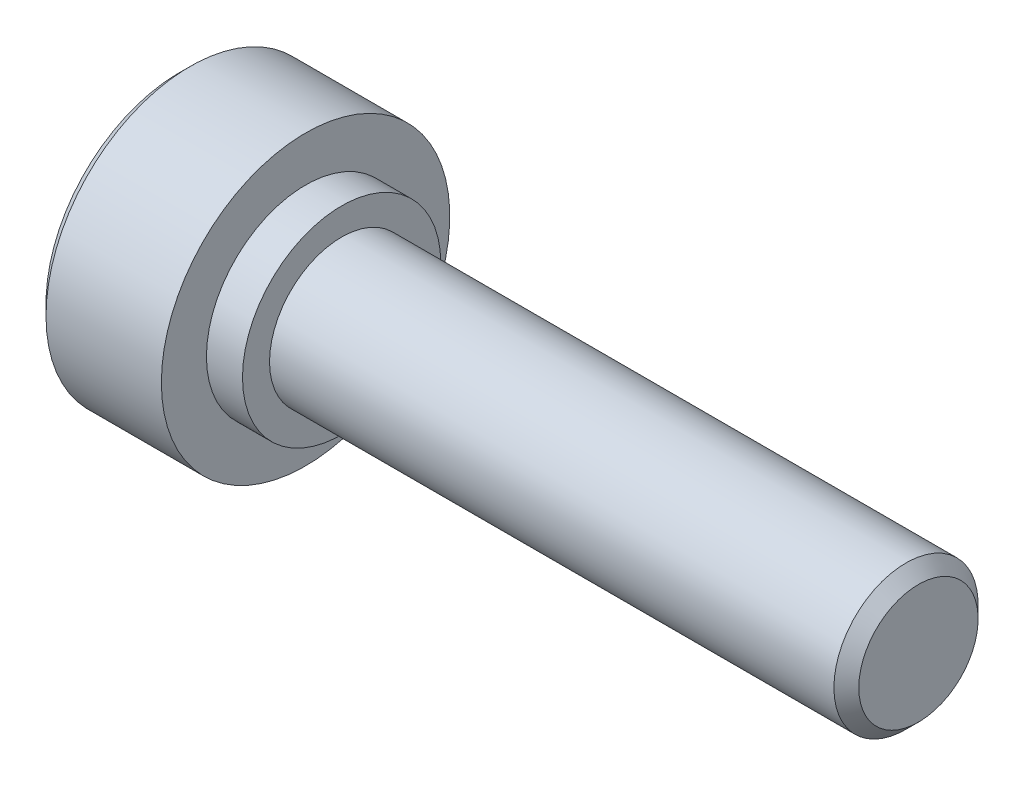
ISO-10303-21;
HEADER;
FILE_DESCRIPTION(('STEP AP214'),'2;1');
FILE_NAME('part.step','',(''),(''),'','','');
FILE_SCHEMA(('AUTOMOTIVE_DESIGN { 1 0 10303 214 1 1 1 1 }'));
ENDSEC;
DATA;
#1=APPLICATION_CONTEXT('core data for automotive mechanical design processes');
#2=APPLICATION_PROTOCOL_DEFINITION('international standard','automotive_design',2000,#1);
#3=PRODUCT_CONTEXT('',#1,'mechanical');
#4=PRODUCT('Part','Part','',(#3));
#5=PRODUCT_RELATED_PRODUCT_CATEGORY('part','',(#4));
#6=PRODUCT_DEFINITION_FORMATION('','',#4);
#7=PRODUCT_DEFINITION_CONTEXT('part definition',#1,'design');
#8=PRODUCT_DEFINITION('design','',#6,#7);
#9=PRODUCT_DEFINITION_SHAPE('','',#8);
#10=(LENGTH_UNIT() NAMED_UNIT(*) SI_UNIT(.MILLI.,.METRE.));
#11=(NAMED_UNIT(*) PLANE_ANGLE_UNIT() SI_UNIT($,.RADIAN.));
#12=(NAMED_UNIT(*) SI_UNIT($,.STERADIAN.) SOLID_ANGLE_UNIT());
#13=UNCERTAINTY_MEASURE_WITH_UNIT(LENGTH_MEASURE(1.E-05),#10,'distance_accuracy_value','');
#14=(GEOMETRIC_REPRESENTATION_CONTEXT(3) GLOBAL_UNCERTAINTY_ASSIGNED_CONTEXT((#13)) GLOBAL_UNIT_ASSIGNED_CONTEXT((#10,
#11,#12)) REPRESENTATION_CONTEXT('',''));
#15=CARTESIAN_POINT('',(0.,0.,0.));
#16=DIRECTION('',(0.,0.,1.));
#17=DIRECTION('',(1.,0.,0.));
#18=AXIS2_PLACEMENT_3D('',#15,#16,#17);
#19=CARTESIAN_POINT('',(0.,0.,0.));
#20=DIRECTION('',(-1.,0.,0.));
#21=DIRECTION('',(0.,0.,1.));
#22=AXIS2_PLACEMENT_3D('',#19,#20,#21);
#23=PLANE('',#22);
#24=CARTESIAN_POINT('',(0.,0.,0.));
#25=DIRECTION('',(-1.,0.,0.));
#26=DIRECTION('',(0.,0.,1.));
#27=AXIS2_PLACEMENT_3D('',#24,#25,#26);
#28=CIRCLE('',#27,7.4);
#29=CARTESIAN_POINT('',(0.,0.,-7.4));
#30=VERTEX_POINT('',#29);
#31=EDGE_CURVE('E45',#30,#30,#28,.T.);
#32=ORIENTED_EDGE('',*,*,#31,.T.);
#33=EDGE_LOOP('',(#32));
#34=FACE_BOUND('',#33,.T.);
#35=DIRECTION('',(0.,-0.5,-0.866025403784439));
#36=VECTOR('',#35,1.);
#37=CARTESIAN_POINT('',(0.,-1.73205080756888,3.));
#38=LINE('',#37,#36);
#39=CARTESIAN_POINT('',(0.,-1.73205080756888,3.));
#40=VERTEX_POINT('',#39);
#41=CARTESIAN_POINT('',(0.,-3.46410161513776,0.));
#42=VERTEX_POINT('',#41);
#43=EDGE_CURVE('E52',#40,#42,#38,.T.);
#44=ORIENTED_EDGE('',*,*,#43,.T.);
#45=DIRECTION('',(0.,0.5,-0.866025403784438));
#46=VECTOR('',#45,1.);
#47=CARTESIAN_POINT('',(0.,-3.46410161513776,0.));
#48=LINE('',#47,#46);
#49=CARTESIAN_POINT('',(0.,-1.73205080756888,-3.));
#50=VERTEX_POINT('',#49);
#51=EDGE_CURVE('E285',#42,#50,#48,.T.);
#52=ORIENTED_EDGE('',*,*,#51,.T.);
#53=DIRECTION('',(0.,1.,0.));
#54=VECTOR('',#53,1.);
#55=CARTESIAN_POINT('',(0.,-1.73205080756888,-3.));
#56=LINE('',#55,#54);
#57=CARTESIAN_POINT('',(0.,1.73205080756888,-3.));
#58=VERTEX_POINT('',#57);
#59=EDGE_CURVE('E132',#50,#58,#56,.T.);
#60=ORIENTED_EDGE('',*,*,#59,.T.);
#61=DIRECTION('',(0.,0.500000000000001,0.866025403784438));
#62=VECTOR('',#61,1.);
#63=CARTESIAN_POINT('',(0.,1.73205080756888,-3.));
#64=LINE('',#63,#62);
#65=CARTESIAN_POINT('',(0.,3.46410161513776,0.));
#66=VERTEX_POINT('',#65);
#67=EDGE_CURVE('E288',#58,#66,#64,.T.);
#68=ORIENTED_EDGE('',*,*,#67,.T.);
#69=DIRECTION('',(0.,-0.500000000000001,0.866025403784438));
#70=VECTOR('',#69,1.);
#71=CARTESIAN_POINT('',(0.,3.46410161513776,0.));
#72=LINE('',#71,#70);
#73=CARTESIAN_POINT('',(0.,1.73205080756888,3.));
#74=VERTEX_POINT('',#73);
#75=EDGE_CURVE('E290',#66,#74,#72,.T.);
#76=ORIENTED_EDGE('',*,*,#75,.T.);
#77=DIRECTION('',(0.,-1.,0.));
#78=VECTOR('',#77,1.);
#79=CARTESIAN_POINT('',(0.,1.73205080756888,3.));
#80=LINE('',#79,#78);
#81=EDGE_CURVE('E292',#74,#40,#80,.T.);
#82=ORIENTED_EDGE('',*,*,#81,.T.);
#83=EDGE_LOOP('',(#44,#52,#60,#68,#76,#82));
#84=FACE_BOUND('',#83,.T.);
#85=ADVANCED_FACE('F37',(#34,#84),#23,.T.);
#86=CARTESIAN_POINT('',(-6.34999999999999,0.,0.));
#87=DIRECTION('',(-1.,0.,0.));
#88=DIRECTION('',(0.,0.,1.));
#89=AXIS2_PLACEMENT_3D('',#86,#87,#88);
#90=CYLINDRICAL_SURFACE('',#89,8.);
#91=CARTESIAN_POINT('',(0.600000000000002,0.,0.));
#92=DIRECTION('',(-1.,0.,0.));
#93=DIRECTION('',(0.,0.,1.));
#94=AXIS2_PLACEMENT_3D('',#91,#92,#93);
#95=CIRCLE('',#94,8.);
#96=CARTESIAN_POINT('',(0.600000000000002,0.,-8.));
#97=VERTEX_POINT('',#96);
#98=EDGE_CURVE('E11',#97,#97,#95,.F.);
#99=ORIENTED_EDGE('',*,*,#98,.T.);
#100=EDGE_LOOP('',(#99));
#101=FACE_BOUND('',#100,.T.);
#102=CARTESIAN_POINT('',(7.,0.,0.));
#103=DIRECTION('',(-1.,0.,0.));
#104=DIRECTION('',(0.,0.,1.));
#105=AXIS2_PLACEMENT_3D('',#102,#103,#104);
#106=CIRCLE('',#105,8.);
#107=CARTESIAN_POINT('',(7.,0.,8.));
#108=VERTEX_POINT('',#107);
#109=EDGE_CURVE('E161',#108,#108,#106,.T.);
#110=ORIENTED_EDGE('',*,*,#109,.T.);
#111=EDGE_LOOP('',(#110));
#112=FACE_BOUND('',#111,.T.);
#113=ADVANCED_FACE('F180',(#101,#112),#90,.T.);
#114=CARTESIAN_POINT('',(7.,8.,0.));
#115=DIRECTION('',(1.,0.,0.));
#116=DIRECTION('',(0.,0.,-1.));
#117=AXIS2_PLACEMENT_3D('',#114,#115,#116);
#118=PLANE('',#117);
#119=CARTESIAN_POINT('',(7.,0.,0.));
#120=DIRECTION('',(-1.,0.,0.));
#121=DIRECTION('',(0.,0.,1.));
#122=AXIS2_PLACEMENT_3D('',#119,#120,#121);
#123=CIRCLE('',#122,5.5);
#124=CARTESIAN_POINT('',(7.,0.,5.5));
#125=VERTEX_POINT('',#124);
#126=EDGE_CURVE('E158',#125,#125,#123,.T.);
#127=ORIENTED_EDGE('',*,*,#126,.T.);
#128=EDGE_LOOP('',(#127));
#129=FACE_BOUND('',#128,.T.);
#130=ORIENTED_EDGE('',*,*,#109,.F.);
#131=EDGE_LOOP('',(#130));
#132=FACE_BOUND('',#131,.T.);
#133=ADVANCED_FACE('F184',(#129,#132),#118,.T.);
#134=CARTESIAN_POINT('',(-6.34999999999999,0.,0.));
#135=DIRECTION('',(-1.,0.,0.));
#136=DIRECTION('',(0.,0.,1.));
#137=AXIS2_PLACEMENT_3D('',#134,#135,#136);
#138=CYLINDRICAL_SURFACE('',#137,5.5);
#139=CARTESIAN_POINT('',(9.,0.,0.));
#140=DIRECTION('',(-1.,0.,0.));
#141=DIRECTION('',(0.,0.,1.));
#142=AXIS2_PLACEMENT_3D('',#139,#140,#141);
#143=CIRCLE('',#142,5.5);
#144=CARTESIAN_POINT('',(9.,0.,5.5));
#145=VERTEX_POINT('',#144);
#146=EDGE_CURVE('E155',#145,#145,#143,.T.);
#147=ORIENTED_EDGE('',*,*,#146,.T.);
#148=EDGE_LOOP('',(#147));
#149=FACE_BOUND('',#148,.T.);
#150=ORIENTED_EDGE('',*,*,#126,.F.);
#151=EDGE_LOOP('',(#150));
#152=FACE_BOUND('',#151,.T.);
#153=ADVANCED_FACE('F190',(#149,#152),#138,.T.);
#154=CARTESIAN_POINT('',(9.,5.5,0.));
#155=DIRECTION('',(1.,0.,0.));
#156=DIRECTION('',(0.,0.,-1.));
#157=AXIS2_PLACEMENT_3D('',#154,#155,#156);
#158=PLANE('',#157);
#159=CARTESIAN_POINT('',(9.,0.,0.));
#160=DIRECTION('',(-1.,0.,0.));
#161=DIRECTION('',(0.,0.,1.));
#162=AXIS2_PLACEMENT_3D('',#159,#160,#161);
#163=CIRCLE('',#162,4.00000000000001);
#164=CARTESIAN_POINT('',(9.,0.,4.00000000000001));
#165=VERTEX_POINT('',#164);
#166=EDGE_CURVE('E152',#165,#165,#163,.T.);
#167=ORIENTED_EDGE('',*,*,#166,.T.);
#168=EDGE_LOOP('',(#167));
#169=FACE_BOUND('',#168,.T.);
#170=ORIENTED_EDGE('',*,*,#146,.F.);
#171=EDGE_LOOP('',(#170));
#172=FACE_BOUND('',#171,.T.);
#173=ADVANCED_FACE('F194',(#169,#172),#158,.T.);
#174=CARTESIAN_POINT('',(-6.34999999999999,0.,0.));
#175=DIRECTION('',(-1.,0.,0.));
#176=DIRECTION('',(0.,0.,1.));
#177=AXIS2_PLACEMENT_3D('',#174,#175,#176);
#178=CYLINDRICAL_SURFACE('',#177,4.00000000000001);
#179=CARTESIAN_POINT('',(40.3095,0.,0.));
#180=DIRECTION('',(-1.,0.,0.));
#181=DIRECTION('',(0.,0.,1.));
#182=AXIS2_PLACEMENT_3D('',#179,#180,#181);
#183=CIRCLE('',#182,4.00000000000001);
#184=CARTESIAN_POINT('',(40.3095,0.,4.00000000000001));
#185=VERTEX_POINT('',#184);
#186=EDGE_CURVE('E149',#185,#185,#183,.T.);
#187=ORIENTED_EDGE('',*,*,#186,.T.);
#188=EDGE_LOOP('',(#187));
#189=FACE_BOUND('',#188,.T.);
#190=ORIENTED_EDGE('',*,*,#166,.F.);
#191=EDGE_LOOP('',(#190));
#192=FACE_BOUND('',#191,.T.);
#193=ADVANCED_FACE('F198',(#189,#192),#178,.T.);
#194=CARTESIAN_POINT('',(40.3095,0.,0.));
#195=DIRECTION('',(-1.,0.,0.));
#196=DIRECTION('',(0.,0.,1.));
#197=AXIS2_PLACEMENT_3D('',#194,#195,#196);
#198=CONICAL_SURFACE('',#197,4.00000000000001,0.785398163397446);
#199=CARTESIAN_POINT('',(41.,0.,0.));
#200=DIRECTION('',(-1.,0.,0.));
#201=DIRECTION('',(0.,0.,1.));
#202=AXIS2_PLACEMENT_3D('',#199,#200,#201);
#203=CIRCLE('',#202,3.3095);
#204=CARTESIAN_POINT('',(41.,0.,3.3095));
#205=VERTEX_POINT('',#204);
#206=EDGE_CURVE('E145',#205,#205,#203,.T.);
#207=ORIENTED_EDGE('',*,*,#206,.T.);
#208=EDGE_LOOP('',(#207));
#209=FACE_BOUND('',#208,.T.);
#210=ORIENTED_EDGE('',*,*,#186,.F.);
#211=EDGE_LOOP('',(#210));
#212=FACE_BOUND('',#211,.T.);
#213=ADVANCED_FACE('F175',(#209,#212),#198,.T.);
#214=CARTESIAN_POINT('',(41.,3.3095,0.));
#215=DIRECTION('',(1.,0.,0.));
#216=DIRECTION('',(0.,0.,-1.));
#217=AXIS2_PLACEMENT_3D('',#214,#215,#216);
#218=PLANE('',#217);
#219=ORIENTED_EDGE('',*,*,#206,.F.);
#220=EDGE_LOOP('',(#219));
#221=FACE_BOUND('',#220,.T.);
#222=ADVANCED_FACE('F168',(#221),#218,.T.);
#223=CARTESIAN_POINT('',(0.,0.,0.));
#224=DIRECTION('',(1.,0.,0.));
#225=DIRECTION('',(0.,0.,-1.));
#226=AXIS2_PLACEMENT_3D('',#223,#224,#225);
#227=CONICAL_SURFACE('',#226,7.4,0.785398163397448);
#228=CARTESIAN_POINT('',(0.600000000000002,0.,-8.));
#229=CARTESIAN_POINT('',(0.593750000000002,0.,-7.99375));
#230=CARTESIAN_POINT('',(0.587500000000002,0.,-7.9875));
#231=CARTESIAN_POINT('',(0.575000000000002,0.,-7.975));
#232=CARTESIAN_POINT('',(0.568750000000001,0.,-7.96875));
#233=CARTESIAN_POINT('',(0.556250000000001,0.,-7.95625));
#234=CARTESIAN_POINT('',(0.550000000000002,0.,-7.95));
#235=CARTESIAN_POINT('',(0.537500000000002,0.,-7.9375));
#236=CARTESIAN_POINT('',(0.531250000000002,0.,-7.93125));
#237=CARTESIAN_POINT('',(0.518750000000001,0.,-7.91875));
#238=CARTESIAN_POINT('',(0.512500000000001,0.,-7.9125));
#239=CARTESIAN_POINT('',(0.500000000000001,0.,-7.9));
#240=CARTESIAN_POINT('',(0.493750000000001,0.,-7.89375));
#241=CARTESIAN_POINT('',(0.481250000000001,0.,-7.88125));
#242=CARTESIAN_POINT('',(0.475000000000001,0.,-7.875));
#243=CARTESIAN_POINT('',(0.462500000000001,0.,-7.8625));
#244=CARTESIAN_POINT('',(0.456250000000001,0.,-7.85625));
#245=CARTESIAN_POINT('',(0.443750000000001,0.,-7.84375));
#246=CARTESIAN_POINT('',(0.437500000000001,0.,-7.8375));
#247=CARTESIAN_POINT('',(0.425000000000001,0.,-7.825));
#248=CARTESIAN_POINT('',(0.418750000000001,0.,-7.81875));
#249=CARTESIAN_POINT('',(0.406250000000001,0.,-7.80625));
#250=CARTESIAN_POINT('',(0.400000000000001,0.,-7.8));
#251=CARTESIAN_POINT('',(0.387500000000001,0.,-7.7875));
#252=CARTESIAN_POINT('',(0.381250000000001,0.,-7.78125));
#253=CARTESIAN_POINT('',(0.368750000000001,0.,-7.76875));
#254=CARTESIAN_POINT('',(0.362500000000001,0.,-7.7625));
#255=CARTESIAN_POINT('',(0.350000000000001,0.,-7.75));
#256=CARTESIAN_POINT('',(0.343750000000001,0.,-7.74375));
#257=CARTESIAN_POINT('',(0.331250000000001,0.,-7.73125));
#258=CARTESIAN_POINT('',(0.325000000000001,0.,-7.725));
#259=CARTESIAN_POINT('',(0.312500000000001,0.,-7.7125));
#260=CARTESIAN_POINT('',(0.306250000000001,0.,-7.70625));
#261=CARTESIAN_POINT('',(0.293750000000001,0.,-7.69375));
#262=CARTESIAN_POINT('',(0.287500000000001,0.,-7.6875));
#263=CARTESIAN_POINT('',(0.275000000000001,0.,-7.675));
#264=CARTESIAN_POINT('',(0.268750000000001,0.,-7.66875));
#265=CARTESIAN_POINT('',(0.256250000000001,0.,-7.65625));
#266=CARTESIAN_POINT('',(0.250000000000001,0.,-7.65));
#267=CARTESIAN_POINT('',(0.237500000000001,0.,-7.6375));
#268=CARTESIAN_POINT('',(0.231250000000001,0.,-7.63125));
#269=CARTESIAN_POINT('',(0.218750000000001,0.,-7.61875));
#270=CARTESIAN_POINT('',(0.2125,0.,-7.6125));
#271=CARTESIAN_POINT('',(0.200000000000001,0.,-7.6));
#272=CARTESIAN_POINT('',(0.193750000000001,0.,-7.59375));
#273=CARTESIAN_POINT('',(0.181250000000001,0.,-7.58125));
#274=CARTESIAN_POINT('',(0.175,0.,-7.575));
#275=CARTESIAN_POINT('',(0.1625,0.,-7.5625));
#276=CARTESIAN_POINT('',(0.15625,0.,-7.55625));
#277=CARTESIAN_POINT('',(0.143750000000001,0.,-7.54375));
#278=CARTESIAN_POINT('',(0.1375,0.,-7.5375));
#279=CARTESIAN_POINT('',(0.125,0.,-7.525));
#280=CARTESIAN_POINT('',(0.11875,0.,-7.51875));
#281=CARTESIAN_POINT('',(0.10625,0.,-7.50625));
#282=CARTESIAN_POINT('',(0.1,0.,-7.5));
#283=CARTESIAN_POINT('',(0.0875000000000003,0.,-7.4875));
#284=CARTESIAN_POINT('',(0.0812500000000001,0.,-7.48125));
#285=CARTESIAN_POINT('',(0.0687500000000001,0.,-7.46875));
#286=CARTESIAN_POINT('',(0.0625000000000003,0.,-7.4625));
#287=CARTESIAN_POINT('',(0.0500000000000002,0.,-7.45));
#288=CARTESIAN_POINT('',(0.0437500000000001,0.,-7.44375));
#289=CARTESIAN_POINT('',(0.03125,0.,-7.43125));
#290=CARTESIAN_POINT('',(0.0250000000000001,0.,-7.425));
#291=CARTESIAN_POINT('',(0.0125000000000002,0.,-7.4125));
#292=CARTESIAN_POINT('',(0.00625000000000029,0.,-7.40625));
#293=CARTESIAN_POINT('',(0.,0.,-7.4));
#294=B_SPLINE_CURVE_WITH_KNOTS('',3,(#228,#229,#230,#231,#232,#233,#234,#235,#236,#237,#238,
#239,#240,#241,#242,#243,#244,#245,#246,#247,#248,#249,#250,#251,#252,#253,#254,#255,#256,#257,
#258,#259,#260,#261,#262,#263,#264,#265,#266,#267,#268,#269,#270,#271,#272,#273,#274,#275,#276,
#277,#278,#279,#280,#281,#282,#283,#284,#285,#286,#287,#288,#289,#290,#291,#292,#293),
.UNSPECIFIED.,.F.,.F.,(4,2,2,2,2,2,2,2,2,2,2,2,2,2,2,2,2,2,2,2,2,2,2,2,2,2,2,2,2,2,2,2,4),(0.,
0.0265165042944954,0.0530330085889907,0.0795495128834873,0.106066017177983,0.132582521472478,
0.159099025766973,0.185615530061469,0.212132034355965,0.23864853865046,0.265165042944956,
0.291681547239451,0.318198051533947,0.344714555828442,0.371231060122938,0.397747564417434,
0.424264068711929,0.450780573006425,0.47729707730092,0.503813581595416,0.530330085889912,
0.556846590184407,0.583363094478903,0.609879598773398,0.636396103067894,0.66291260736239,
0.689429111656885,0.715945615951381,0.742462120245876,0.768978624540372,0.795495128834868,
0.822011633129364,0.848528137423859),.UNSPECIFIED.);
#295=EDGE_CURVE('BSEAM39',#97,#30,#294,.T.);
#296=ORIENTED_EDGE('',*,*,#98,.F.);
#297=ORIENTED_EDGE('',*,*,#31,.F.);
#298=ORIENTED_EDGE('',*,*,#295,.T.);
#299=ORIENTED_EDGE('',*,*,#295,.F.);
#300=EDGE_LOOP('',(#296,#298,#297,#299));
#301=FACE_BOUND('',#300,.T.);
#302=ADVANCED_FACE('F39',(#301),#227,.T.);
#303=CARTESIAN_POINT('',(4.2,-3.46410161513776,0.));
#304=DIRECTION('',(0.,0.866025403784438,0.5));
#305=DIRECTION('',(0.,-0.5,0.866025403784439));
#306=AXIS2_PLACEMENT_3D('',#303,#304,#305);
#307=PLANE('',#306);
#308=DIRECTION('',(0.,0.5,-0.866025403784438));
#309=VECTOR('',#308,1.);
#310=CARTESIAN_POINT('',(4.2,-3.46410161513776,0.));
#311=LINE('',#310,#309);
#312=CARTESIAN_POINT('',(4.2,-3.46410161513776,0.));
#313=VERTEX_POINT('',#312);
#314=CARTESIAN_POINT('',(4.2,-2.59807621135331,-1.5));
#315=VERTEX_POINT('',#314);
#316=EDGE_CURVE('E60',#313,#315,#311,.T.);
#317=ORIENTED_EDGE('',*,*,#316,.T.);
#318=CARTESIAN_POINT('',(4.2,-1.73205080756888,-3.));
#319=VERTEX_POINT('',#318);
#320=EDGE_CURVE('E110',#315,#319,#311,.T.);
#321=ORIENTED_EDGE('',*,*,#320,.T.);
#322=DIRECTION('',(-1.,0.,0.));
#323=VECTOR('',#322,1.);
#324=CARTESIAN_POINT('',(4.2,-1.73205080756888,-3.));
#325=LINE('',#324,#323);
#326=EDGE_CURVE('E114',#319,#50,#325,.T.);
#327=ORIENTED_EDGE('',*,*,#326,.T.);
#328=ORIENTED_EDGE('',*,*,#51,.F.);
#329=DIRECTION('',(-1.,0.,0.));
#330=VECTOR('',#329,1.);
#331=CARTESIAN_POINT('',(4.2,-3.46410161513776,0.));
#332=LINE('',#331,#330);
#333=EDGE_CURVE('E284',#313,#42,#332,.T.);
#334=ORIENTED_EDGE('',*,*,#333,.F.);
#335=EDGE_LOOP('',(#317,#321,#327,#328,#334));
#336=FACE_BOUND('',#335,.T.);
#337=ADVANCED_FACE('F112',(#336),#307,.T.);
#338=CARTESIAN_POINT('',(4.2,-1.73205080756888,-3.));
#339=DIRECTION('',(0.,0.,1.));
#340=DIRECTION('',(0.,-1.,0.));
#341=AXIS2_PLACEMENT_3D('',#338,#339,#340);
#342=PLANE('',#341);
#343=DIRECTION('',(0.,1.,0.));
#344=VECTOR('',#343,1.);
#345=CARTESIAN_POINT('',(4.2,-1.73205080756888,-3.));
#346=LINE('',#345,#344);
#347=CARTESIAN_POINT('',(4.2,0.,-3.));
#348=VERTEX_POINT('',#347);
#349=EDGE_CURVE('E119',#319,#348,#346,.T.);
#350=ORIENTED_EDGE('',*,*,#349,.T.);
#351=CARTESIAN_POINT('',(4.2,1.73205080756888,-3.));
#352=VERTEX_POINT('',#351);
#353=EDGE_CURVE('E127',#348,#352,#346,.T.);
#354=ORIENTED_EDGE('',*,*,#353,.T.);
#355=DIRECTION('',(-1.,0.,0.));
#356=VECTOR('',#355,1.);
#357=CARTESIAN_POINT('',(4.2,1.73205080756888,-3.));
#358=LINE('',#357,#356);
#359=EDGE_CURVE('E134',#352,#58,#358,.T.);
#360=ORIENTED_EDGE('',*,*,#359,.T.);
#361=ORIENTED_EDGE('',*,*,#59,.F.);
#362=ORIENTED_EDGE('',*,*,#326,.F.);
#363=EDGE_LOOP('',(#350,#354,#360,#361,#362));
#364=FACE_BOUND('',#363,.T.);
#365=ADVANCED_FACE('F130',(#364),#342,.T.);
#366=CARTESIAN_POINT('',(4.2,1.73205080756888,-3.));
#367=DIRECTION('',(0.,-0.866025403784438,0.500000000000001));
#368=DIRECTION('',(0.,-0.500000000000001,-0.866025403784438));
#369=AXIS2_PLACEMENT_3D('',#366,#367,#368);
#370=PLANE('',#369);
#371=DIRECTION('',(0.,0.500000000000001,0.866025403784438));
#372=VECTOR('',#371,1.);
#373=CARTESIAN_POINT('',(4.2,1.73205080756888,-3.));
#374=LINE('',#373,#372);
#375=CARTESIAN_POINT('',(4.2,2.59807621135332,-1.5));
#376=VERTEX_POINT('',#375);
#377=EDGE_CURVE('E248',#352,#376,#374,.T.);
#378=ORIENTED_EDGE('',*,*,#377,.T.);
#379=CARTESIAN_POINT('',(4.2,3.46410161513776,0.));
#380=VERTEX_POINT('',#379);
#381=EDGE_CURVE('E126',#376,#380,#374,.T.);
#382=ORIENTED_EDGE('',*,*,#381,.T.);
#383=DIRECTION('',(-1.,0.,0.));
#384=VECTOR('',#383,1.);
#385=CARTESIAN_POINT('',(4.2,3.46410161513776,0.));
#386=LINE('',#385,#384);
#387=EDGE_CURVE('E140',#380,#66,#386,.T.);
#388=ORIENTED_EDGE('',*,*,#387,.T.);
#389=ORIENTED_EDGE('',*,*,#67,.F.);
#390=ORIENTED_EDGE('',*,*,#359,.F.);
#391=EDGE_LOOP('',(#378,#382,#388,#389,#390));
#392=FACE_BOUND('',#391,.T.);
#393=ADVANCED_FACE('F212',(#392),#370,.T.);
#394=CARTESIAN_POINT('',(4.2,3.46410161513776,0.));
#395=DIRECTION('',(0.,-0.866025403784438,-0.500000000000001));
#396=DIRECTION('',(0.,0.500000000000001,-0.866025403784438));
#397=AXIS2_PLACEMENT_3D('',#394,#395,#396);
#398=PLANE('',#397);
#399=DIRECTION('',(0.,-0.500000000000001,0.866025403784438));
#400=VECTOR('',#399,1.);
#401=CARTESIAN_POINT('',(4.2,3.46410161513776,0.));
#402=LINE('',#401,#400);
#403=CARTESIAN_POINT('',(4.2,2.59807621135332,1.5));
#404=VERTEX_POINT('',#403);
#405=EDGE_CURVE('E253',#380,#404,#402,.T.);
#406=ORIENTED_EDGE('',*,*,#405,.T.);
#407=CARTESIAN_POINT('',(4.2,1.73205080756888,3.));
#408=VERTEX_POINT('',#407);
#409=EDGE_CURVE('E259',#404,#408,#402,.T.);
#410=ORIENTED_EDGE('',*,*,#409,.T.);
#411=DIRECTION('',(-1.,0.,0.));
#412=VECTOR('',#411,1.);
#413=CARTESIAN_POINT('',(4.2,1.73205080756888,3.));
#414=LINE('',#413,#412);
#415=EDGE_CURVE('E279',#408,#74,#414,.T.);
#416=ORIENTED_EDGE('',*,*,#415,.T.);
#417=ORIENTED_EDGE('',*,*,#75,.F.);
#418=ORIENTED_EDGE('',*,*,#387,.F.);
#419=EDGE_LOOP('',(#406,#410,#416,#417,#418));
#420=FACE_BOUND('',#419,.T.);
#421=ADVANCED_FACE('F215',(#420),#398,.T.);
#422=CARTESIAN_POINT('',(4.2,1.73205080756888,3.));
#423=DIRECTION('',(0.,0.,-1.));
#424=DIRECTION('',(-1.,0.,0.));
#425=AXIS2_PLACEMENT_3D('',#422,#423,#424);
#426=PLANE('',#425);
#427=DIRECTION('',(0.,-1.,0.));
#428=VECTOR('',#427,1.);
#429=CARTESIAN_POINT('',(4.2,1.73205080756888,3.));
#430=LINE('',#429,#428);
#431=CARTESIAN_POINT('',(4.2,0.,3.));
#432=VERTEX_POINT('',#431);
#433=EDGE_CURVE('E266',#408,#432,#430,.T.);
#434=ORIENTED_EDGE('',*,*,#433,.T.);
#435=CARTESIAN_POINT('',(4.2,-1.73205080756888,3.));
#436=VERTEX_POINT('',#435);
#437=EDGE_CURVE('E269',#432,#436,#430,.T.);
#438=ORIENTED_EDGE('',*,*,#437,.T.);
#439=DIRECTION('',(-1.,0.,0.));
#440=VECTOR('',#439,1.);
#441=CARTESIAN_POINT('',(4.2,-1.73205080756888,3.));
#442=LINE('',#441,#440);
#443=EDGE_CURVE('E297',#436,#40,#442,.T.);
#444=ORIENTED_EDGE('',*,*,#443,.T.);
#445=ORIENTED_EDGE('',*,*,#81,.F.);
#446=ORIENTED_EDGE('',*,*,#415,.F.);
#447=EDGE_LOOP('',(#434,#438,#444,#445,#446));
#448=FACE_BOUND('',#447,.T.);
#449=ADVANCED_FACE('F219',(#448),#426,.T.);
#450=CARTESIAN_POINT('',(4.2,-1.73205080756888,3.));
#451=DIRECTION('',(0.,0.866025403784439,-0.5));
#452=DIRECTION('',(0.,0.5,0.866025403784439));
#453=AXIS2_PLACEMENT_3D('',#450,#451,#452);
#454=PLANE('',#453);
#455=DIRECTION('',(0.,-0.5,-0.866025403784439));
#456=VECTOR('',#455,1.);
#457=CARTESIAN_POINT('',(4.2,-1.73205080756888,3.));
#458=LINE('',#457,#456);
#459=CARTESIAN_POINT('',(4.2,-2.59807621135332,1.5));
#460=VERTEX_POINT('',#459);
#461=EDGE_CURVE('E272',#436,#460,#458,.T.);
#462=ORIENTED_EDGE('',*,*,#461,.T.);
#463=EDGE_CURVE('E280',#460,#313,#458,.T.);
#464=ORIENTED_EDGE('',*,*,#463,.T.);
#465=ORIENTED_EDGE('',*,*,#333,.T.);
#466=ORIENTED_EDGE('',*,*,#43,.F.);
#467=ORIENTED_EDGE('',*,*,#443,.F.);
#468=EDGE_LOOP('',(#462,#464,#465,#466,#467));
#469=FACE_BOUND('',#468,.T.);
#470=ADVANCED_FACE('F223',(#469),#454,.T.);
#471=CARTESIAN_POINT('',(4.2,0.,-5.99999999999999));
#472=DIRECTION('',(1.,0.,0.));
#473=DIRECTION('',(0.,0.,-1.));
#474=AXIS2_PLACEMENT_3D('',#471,#472,#473);
#475=PLANE('',#474);
#476=CARTESIAN_POINT('',(4.2,0.,0.));
#477=DIRECTION('',(-1.,0.,0.));
#478=DIRECTION('',(0.,0.,1.));
#479=AXIS2_PLACEMENT_3D('',#476,#477,#478);
#480=CIRCLE('',#479,3.);
#481=EDGE_CURVE('E245',#376,#348,#480,.T.);
#482=ORIENTED_EDGE('',*,*,#481,.F.);
#483=ORIENTED_EDGE('',*,*,#377,.F.);
#484=ORIENTED_EDGE('',*,*,#353,.F.);
#485=EDGE_LOOP('',(#482,#483,#484));
#486=FACE_BOUND('',#485,.T.);
#487=ADVANCED_FACE('F227',(#486),#475,.F.);
#488=EDGE_CURVE('E146',#404,#376,#480,.T.);
#489=ORIENTED_EDGE('',*,*,#488,.F.);
#490=ORIENTED_EDGE('',*,*,#405,.F.);
#491=ORIENTED_EDGE('',*,*,#381,.F.);
#492=EDGE_LOOP('',(#489,#490,#491));
#493=FACE_BOUND('',#492,.T.);
#494=ADVANCED_FACE('F237',(#493),#475,.F.);
#495=EDGE_CURVE('E139',#432,#404,#480,.T.);
#496=ORIENTED_EDGE('',*,*,#495,.F.);
#497=ORIENTED_EDGE('',*,*,#433,.F.);
#498=ORIENTED_EDGE('',*,*,#409,.F.);
#499=EDGE_LOOP('',(#496,#497,#498));
#500=FACE_BOUND('',#499,.T.);
#501=ADVANCED_FACE('F242',(#500),#475,.F.);
#502=EDGE_CURVE('E133',#460,#432,#480,.T.);
#503=ORIENTED_EDGE('',*,*,#502,.F.);
#504=ORIENTED_EDGE('',*,*,#461,.F.);
#505=ORIENTED_EDGE('',*,*,#437,.F.);
#506=EDGE_LOOP('',(#503,#504,#505));
#507=FACE_BOUND('',#506,.T.);
#508=ADVANCED_FACE('F234',(#507),#475,.F.);
#509=EDGE_CURVE('E137',#315,#460,#480,.T.);
#510=ORIENTED_EDGE('',*,*,#509,.F.);
#511=ORIENTED_EDGE('',*,*,#316,.F.);
#512=ORIENTED_EDGE('',*,*,#463,.F.);
#513=EDGE_LOOP('',(#510,#511,#512));
#514=FACE_BOUND('',#513,.T.);
#515=ADVANCED_FACE('F230',(#514),#475,.F.);
#516=EDGE_CURVE('E122',#348,#315,#480,.T.);
#517=ORIENTED_EDGE('',*,*,#516,.F.);
#518=ORIENTED_EDGE('',*,*,#349,.F.);
#519=ORIENTED_EDGE('',*,*,#320,.F.);
#520=EDGE_LOOP('',(#517,#518,#519));
#521=FACE_BOUND('',#520,.T.);
#522=ADVANCED_FACE('F120',(#521),#475,.F.);
#523=CARTESIAN_POINT('',(5.9320508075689,0.,0.));
#524=DIRECTION('',(-1.,0.,0.));
#525=DIRECTION('',(0.,0.,1.));
#526=AXIS2_PLACEMENT_3D('',#523,#524,#525);
#527=CONICAL_SURFACE('',#526,0.,1.04719755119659);
#528=ORIENTED_EDGE('',*,*,#495,.T.);
#529=ORIENTED_EDGE('',*,*,#488,.T.);
#530=ORIENTED_EDGE('',*,*,#481,.T.);
#531=ORIENTED_EDGE('',*,*,#516,.T.);
#532=ORIENTED_EDGE('',*,*,#509,.T.);
#533=ORIENTED_EDGE('',*,*,#502,.T.);
#534=EDGE_LOOP('',(#528,#529,#530,#531,#532,#533));
#535=FACE_BOUND('',#534,.T.);
#536=CARTESIAN_POINT('',(5.9320508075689,0.,0.));
#537=VERTEX_POINT('',#536);
#538=VERTEX_LOOP('',#537);
#539=FACE_BOUND('',#538,.T.);
#540=ADVANCED_FACE('F206',(#535,#539),#527,.F.);
#541=CLOSED_SHELL('',(#85,#113,#133,#153,#173,#193,#213,#222,#302,#337,#365,#393,#421,#449,#470,
#487,#494,#501,#508,#515,#522,#540));
#542=MANIFOLD_SOLID_BREP('B2',#541);
#543=ADVANCED_BREP_SHAPE_REPRESENTATION('',(#18,#542),#14);
#544=SHAPE_DEFINITION_REPRESENTATION(#9,#543);
ENDSEC;
END-ISO-10303-21;
